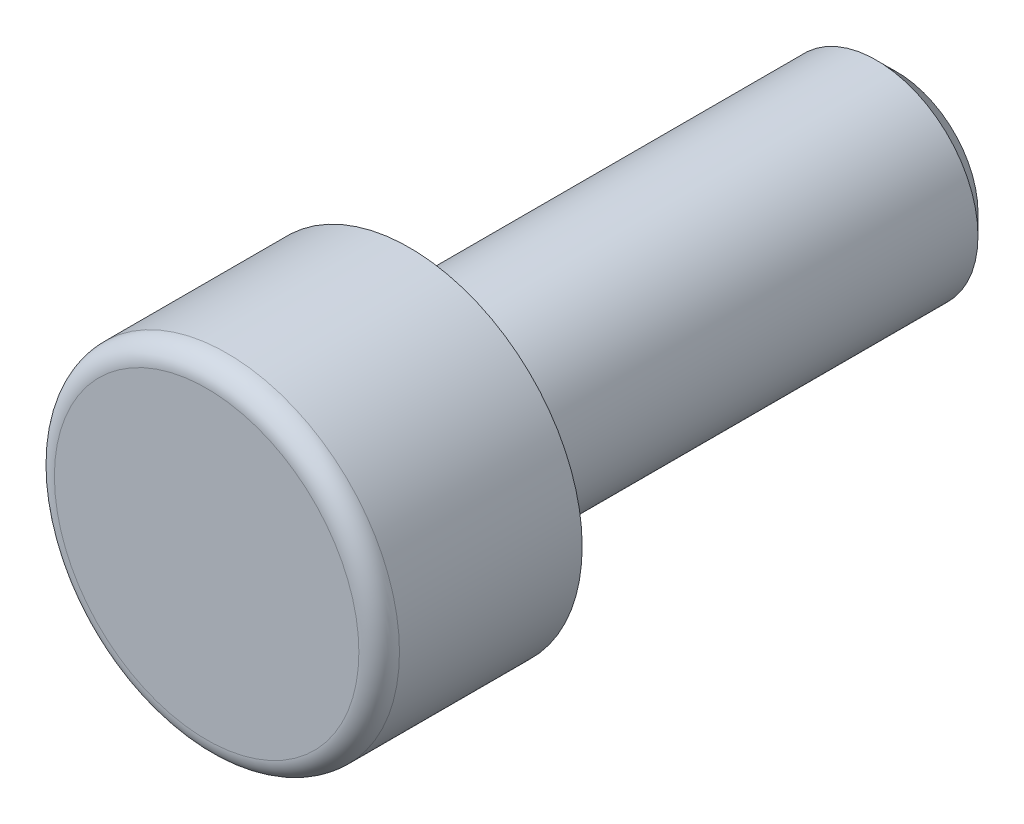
ISO-10303-21;
HEADER;
FILE_DESCRIPTION(('STEP AP214'),'2;1');
FILE_NAME('part.step','',(''),(''),'','','');
FILE_SCHEMA(('AUTOMOTIVE_DESIGN { 1 0 10303 214 1 1 1 1 }'));
ENDSEC;
DATA;
#1=APPLICATION_CONTEXT('core data for automotive mechanical design processes');
#2=APPLICATION_PROTOCOL_DEFINITION('international standard','automotive_design',2000,#1);
#3=PRODUCT_CONTEXT('',#1,'mechanical');
#4=PRODUCT('Part','Part','',(#3));
#5=PRODUCT_RELATED_PRODUCT_CATEGORY('part','',(#4));
#6=PRODUCT_DEFINITION_FORMATION('','',#4);
#7=PRODUCT_DEFINITION_CONTEXT('part definition',#1,'design');
#8=PRODUCT_DEFINITION('design','',#6,#7);
#9=PRODUCT_DEFINITION_SHAPE('','',#8);
#10=(LENGTH_UNIT() NAMED_UNIT(*) SI_UNIT(.MILLI.,.METRE.));
#11=(NAMED_UNIT(*) PLANE_ANGLE_UNIT() SI_UNIT($,.RADIAN.));
#12=(NAMED_UNIT(*) SI_UNIT($,.STERADIAN.) SOLID_ANGLE_UNIT());
#13=UNCERTAINTY_MEASURE_WITH_UNIT(LENGTH_MEASURE(1.E-05),#10,'distance_accuracy_value','');
#14=(GEOMETRIC_REPRESENTATION_CONTEXT(3) GLOBAL_UNCERTAINTY_ASSIGNED_CONTEXT((#13)) GLOBAL_UNIT_ASSIGNED_CONTEXT((#10,
#11,#12)) REPRESENTATION_CONTEXT('',''));
#15=CARTESIAN_POINT('',(0.,0.,0.));
#16=DIRECTION('',(0.,0.,1.));
#17=DIRECTION('',(1.,0.,0.));
#18=AXIS2_PLACEMENT_3D('',#15,#16,#17);
#19=CARTESIAN_POINT('',(0.,0.,5.));
#20=DIRECTION('',(0.,0.,1.));
#21=DIRECTION('',(1.,0.,0.));
#22=AXIS2_PLACEMENT_3D('',#19,#20,#21);
#23=PLANE('',#22);
#24=CARTESIAN_POINT('',(0.,0.,5.));
#25=DIRECTION('',(0.,0.,-1.));
#26=DIRECTION('',(1.,0.,0.));
#27=AXIS2_PLACEMENT_3D('',#24,#25,#26);
#28=CIRCLE('',#27,3.75);
#29=CARTESIAN_POINT('',(3.75,0.,5.));
#30=VERTEX_POINT('',#29);
#31=CARTESIAN_POINT('',(-3.75,0.,5.));
#32=VERTEX_POINT('',#31);
#33=EDGE_CURVE('E37',#30,#32,#28,.T.);
#34=ORIENTED_EDGE('',*,*,#33,.F.);
#35=CARTESIAN_POINT('',(0.,0.,5.));
#36=DIRECTION('',(0.,0.,-1.));
#37=DIRECTION('',(-1.,0.,0.));
#38=AXIS2_PLACEMENT_3D('',#35,#36,#37);
#39=CIRCLE('',#38,3.75);
#40=EDGE_CURVE('E33',#32,#30,#39,.T.);
#41=ORIENTED_EDGE('',*,*,#40,.F.);
#42=EDGE_LOOP('',(#34,#41));
#43=FACE_BOUND('',#42,.T.);
#44=ADVANCED_FACE('F16',(#43),#23,.T.);
#45=CARTESIAN_POINT('',(0.,0.,4.5));
#46=DIRECTION('',(0.,0.,1.));
#47=DIRECTION('',(1.,0.,0.));
#48=AXIS2_PLACEMENT_3D('',#45,#46,#47);
#49=TOROIDAL_SURFACE('',#48,3.75,0.5);
#50=CARTESIAN_POINT('',(0.,0.,4.5));
#51=DIRECTION('',(0.,0.,1.));
#52=DIRECTION('',(1.,0.,0.));
#53=AXIS2_PLACEMENT_3D('',#50,#51,#52);
#54=CIRCLE('',#53,4.25);
#55=CARTESIAN_POINT('',(4.25,0.,4.5));
#56=VERTEX_POINT('',#55);
#57=EDGE_CURVE('E43',#56,#56,#54,.F.);
#58=ORIENTED_EDGE('',*,*,#57,.F.);
#59=EDGE_LOOP('',(#58));
#60=FACE_BOUND('',#59,.T.);
#61=ORIENTED_EDGE('',*,*,#33,.T.);
#62=ORIENTED_EDGE('',*,*,#40,.T.);
#63=EDGE_LOOP('',(#61,#62));
#64=FACE_BOUND('',#63,.T.);
#65=ADVANCED_FACE('F42',(#60,#64),#49,.T.);
#66=CARTESIAN_POINT('',(0.,0.,-12.));
#67=DIRECTION('',(0.,0.,-1.));
#68=DIRECTION('',(-1.,0.,0.));
#69=AXIS2_PLACEMENT_3D('',#66,#67,#68);
#70=PLANE('',#69);
#71=CARTESIAN_POINT('',(0.,0.,-12.0000000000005));
#72=DIRECTION('',(0.,0.,1.));
#73=DIRECTION('',(1.,0.,0.));
#74=AXIS2_PLACEMENT_3D('',#71,#72,#73);
#75=CIRCLE('',#74,2.00000000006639);
#76=CARTESIAN_POINT('',(2.00000000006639,0.,-12.0000000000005));
#77=VERTEX_POINT('',#76);
#78=EDGE_CURVE('E74',#77,#77,#75,.T.);
#79=ORIENTED_EDGE('',*,*,#78,.F.);
#80=EDGE_LOOP('',(#79));
#81=FACE_BOUND('',#80,.T.);
#82=ADVANCED_FACE('F59',(#81),#70,.T.);
#83=CARTESIAN_POINT('',(0.,0.,0.));
#84=DIRECTION('',(0.,0.,1.));
#85=DIRECTION('',(1.,0.,0.));
#86=AXIS2_PLACEMENT_3D('',#83,#84,#85);
#87=CYLINDRICAL_SURFACE('',#86,4.25);
#88=ORIENTED_EDGE('',*,*,#57,.T.);
#89=EDGE_LOOP('',(#88));
#90=FACE_BOUND('',#89,.T.);
#91=CARTESIAN_POINT('',(0.,0.,0.));
#92=DIRECTION('',(0.,0.,1.));
#93=DIRECTION('',(1.,0.,0.));
#94=AXIS2_PLACEMENT_3D('',#91,#92,#93);
#95=CIRCLE('',#94,4.25);
#96=CARTESIAN_POINT('',(4.25,0.,0.));
#97=VERTEX_POINT('',#96);
#98=EDGE_CURVE('E76',#97,#97,#95,.T.);
#99=ORIENTED_EDGE('',*,*,#98,.T.);
#100=EDGE_LOOP('',(#99));
#101=FACE_BOUND('',#100,.T.);
#102=ADVANCED_FACE('F89',(#90,#101),#87,.T.);
#103=CARTESIAN_POINT('',(0.,0.,-11.5000000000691));
#104=DIRECTION('',(0.,0.,1.));
#105=DIRECTION('',(1.,0.,0.));
#106=AXIS2_PLACEMENT_3D('',#103,#104,#105);
#107=CONICAL_SURFACE('',#106,2.49999999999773,0.785398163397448);
#108=CARTESIAN_POINT('',(0.,0.,-11.5));
#109=DIRECTION('',(0.,0.,-1.));
#110=DIRECTION('',(-1.,0.,0.));
#111=AXIS2_PLACEMENT_3D('',#108,#109,#110);
#112=CIRCLE('',#111,2.5);
#113=CARTESIAN_POINT('',(-2.5,0.,-11.5));
#114=VERTEX_POINT('',#113);
#115=EDGE_CURVE('E27',#114,#114,#112,.F.);
#116=ORIENTED_EDGE('',*,*,#115,.F.);
#117=EDGE_LOOP('',(#116));
#118=FACE_BOUND('',#117,.T.);
#119=ORIENTED_EDGE('',*,*,#78,.T.);
#120=EDGE_LOOP('',(#119));
#121=FACE_BOUND('',#120,.T.);
#122=ADVANCED_FACE('F86',(#118,#121),#107,.T.);
#123=CARTESIAN_POINT('',(0.,0.,0.));
#124=DIRECTION('',(0.,0.,1.));
#125=DIRECTION('',(1.,0.,0.));
#126=AXIS2_PLACEMENT_3D('',#123,#124,#125);
#127=PLANE('',#126);
#128=CARTESIAN_POINT('',(0.,0.,0.));
#129=DIRECTION('',(0.,0.,-1.));
#130=DIRECTION('',(-1.,0.,0.));
#131=AXIS2_PLACEMENT_3D('',#128,#129,#130);
#132=CIRCLE('',#131,2.5);
#133=CARTESIAN_POINT('',(-2.5,0.,0.));
#134=VERTEX_POINT('',#133);
#135=EDGE_CURVE('E11',#134,#134,#132,.T.);
#136=ORIENTED_EDGE('',*,*,#135,.F.);
#137=EDGE_LOOP('',(#136));
#138=FACE_BOUND('',#137,.T.);
#139=ORIENTED_EDGE('',*,*,#98,.F.);
#140=EDGE_LOOP('',(#139));
#141=FACE_BOUND('',#140,.T.);
#142=ADVANCED_FACE('F97',(#138,#141),#127,.F.);
#143=CARTESIAN_POINT('',(0.,0.,0.));
#144=DIRECTION('',(0.,0.,-1.));
#145=DIRECTION('',(-1.,0.,0.));
#146=AXIS2_PLACEMENT_3D('',#143,#144,#145);
#147=CYLINDRICAL_SURFACE('',#146,2.5);
#148=ORIENTED_EDGE('',*,*,#115,.T.);
#149=EDGE_LOOP('',(#148));
#150=FACE_BOUND('',#149,.T.);
#151=ORIENTED_EDGE('',*,*,#135,.T.);
#152=EDGE_LOOP('',(#151));
#153=FACE_BOUND('',#152,.T.);
#154=ADVANCED_FACE('F95',(#150,#153),#147,.T.);
#155=CLOSED_SHELL('',(#44,#65,#82,#102,#122,#142,#154));
#156=MANIFOLD_SOLID_BREP('B1',#155);
#157=ADVANCED_BREP_SHAPE_REPRESENTATION('',(#18,#156),#14);
#158=SHAPE_DEFINITION_REPRESENTATION(#9,#157);
ENDSEC;
END-ISO-10303-21;
